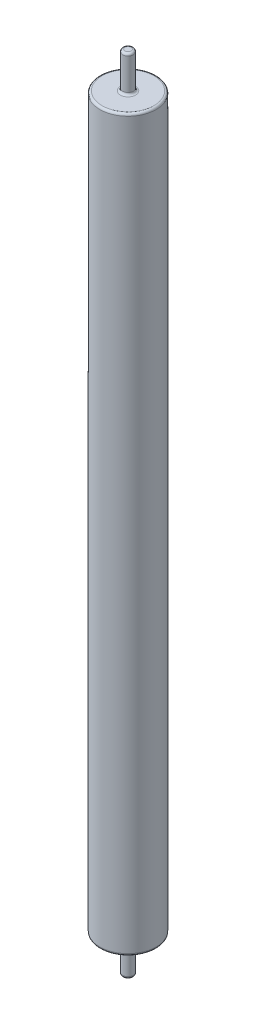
ISO-10303-21;
HEADER;
FILE_DESCRIPTION(('STEP AP214'),'2;1');
FILE_NAME('part.step','',(''),(''),'','','');
FILE_SCHEMA(('AUTOMOTIVE_DESIGN { 1 0 10303 214 1 1 1 1 }'));
ENDSEC;
DATA;
#1=APPLICATION_CONTEXT('core data for automotive mechanical design processes');
#2=APPLICATION_PROTOCOL_DEFINITION('international standard','automotive_design',2000,#1);
#3=PRODUCT_CONTEXT('',#1,'mechanical');
#4=PRODUCT('Part','Part','',(#3));
#5=PRODUCT_RELATED_PRODUCT_CATEGORY('part','',(#4));
#6=PRODUCT_DEFINITION_FORMATION('','',#4);
#7=PRODUCT_DEFINITION_CONTEXT('part definition',#1,'design');
#8=PRODUCT_DEFINITION('design','',#6,#7);
#9=PRODUCT_DEFINITION_SHAPE('','',#8);
#10=(LENGTH_UNIT() NAMED_UNIT(*) SI_UNIT(.MILLI.,.METRE.));
#11=(NAMED_UNIT(*) PLANE_ANGLE_UNIT() SI_UNIT($,.RADIAN.));
#12=(NAMED_UNIT(*) SI_UNIT($,.STERADIAN.) SOLID_ANGLE_UNIT());
#13=UNCERTAINTY_MEASURE_WITH_UNIT(LENGTH_MEASURE(1.E-05),#10,'distance_accuracy_value','');
#14=(GEOMETRIC_REPRESENTATION_CONTEXT(3) GLOBAL_UNCERTAINTY_ASSIGNED_CONTEXT((#13)) GLOBAL_UNIT_ASSIGNED_CONTEXT((#10,
#11,#12)) REPRESENTATION_CONTEXT('',''));
#15=CARTESIAN_POINT('',(0.,0.,0.));
#16=DIRECTION('',(0.,0.,1.));
#17=DIRECTION('',(1.,0.,0.));
#18=AXIS2_PLACEMENT_3D('',#15,#16,#17);
#19=CARTESIAN_POINT('',(0.,712.,0.));
#20=DIRECTION('',(0.,-1.,0.));
#21=DIRECTION('',(0.,0.,-1.));
#22=AXIS2_PLACEMENT_3D('',#19,#20,#21);
#23=CYLINDRICAL_SURFACE('',#22,25.);
#24=CARTESIAN_POINT('',(-24.4803692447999,337.95,-5.07065297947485));
#25=CARTESIAN_POINT('',(-24.4803704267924,338.033065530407,-5.07064911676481));
#26=CARTESIAN_POINT('',(-24.4818068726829,338.116190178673,-5.06372760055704));
#27=CARTESIAN_POINT('',(-24.4874759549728,338.280119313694,-5.03623969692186));
#28=CARTESIAN_POINT('',(-24.4917118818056,338.360920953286,-5.01565725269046));
#29=CARTESIAN_POINT('',(-24.5027368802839,338.517779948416,-4.96151622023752));
#30=CARTESIAN_POINT('',(-24.5095234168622,338.593841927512,-4.92797051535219));
#31=CARTESIAN_POINT('',(-24.5252820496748,338.739204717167,-4.84893353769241));
#32=CARTESIAN_POINT('',(-24.5342537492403,338.808506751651,-4.80344443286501));
#33=CARTESIAN_POINT('',(-24.5540326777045,338.939239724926,-4.70129837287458));
#34=CARTESIAN_POINT('',(-24.5648585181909,339.000578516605,-4.64452713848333));
#35=CARTESIAN_POINT('',(-24.5877554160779,339.11290568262,-4.52174491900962));
#36=CARTESIAN_POINT('',(-24.5998266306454,339.163892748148,-4.45573276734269));
#37=CARTESIAN_POINT('',(-24.6249023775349,339.255018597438,-4.31501722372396));
#38=CARTESIAN_POINT('',(-24.6379198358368,339.294944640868,-4.24017830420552));
#39=CARTESIAN_POINT('',(-24.6641433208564,339.361635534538,-4.08487836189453));
#40=CARTESIAN_POINT('',(-24.6773493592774,339.38839956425,-4.00441698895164));
#41=CARTESIAN_POINT('',(-24.7035764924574,339.428207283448,-3.83931697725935));
#42=CARTESIAN_POINT('',(-24.7165946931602,339.441120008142,-3.75464625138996));
#43=CARTESIAN_POINT('',(-24.7418818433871,339.452367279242,-3.58422959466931));
#44=CARTESIAN_POINT('',(-24.7541508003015,339.450701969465,-3.49848367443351));
#45=CARTESIAN_POINT('',(-24.7775641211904,339.432797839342,-3.32861065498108));
#46=CARTESIAN_POINT('',(-24.7887114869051,339.416599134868,-3.24447975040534));
#47=CARTESIAN_POINT('',(-24.8096794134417,339.370071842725,-3.08004553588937));
#48=CARTESIAN_POINT('',(-24.8195000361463,339.339743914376,-2.99974204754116));
#49=CARTESIAN_POINT('',(-24.8375915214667,339.266108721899,-2.84604775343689));
#50=CARTESIAN_POINT('',(-24.8458757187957,339.222922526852,-2.77260051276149));
#51=CARTESIAN_POINT('',(-24.8609550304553,339.124664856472,-2.63396742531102));
#52=CARTESIAN_POINT('',(-24.8677502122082,339.0695939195,-2.56878120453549));
#53=CARTESIAN_POINT('',(-24.8798208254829,338.949624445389,-2.44910440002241));
#54=CARTESIAN_POINT('',(-24.885108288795,338.884810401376,-2.39453031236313));
#55=CARTESIAN_POINT('',(-24.8942986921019,338.746863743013,-2.29701960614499));
#56=CARTESIAN_POINT('',(-24.8982016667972,338.673731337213,-2.25408269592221));
#57=CARTESIAN_POINT('',(-24.9046861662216,338.521576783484,-2.18127111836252));
#58=CARTESIAN_POINT('',(-24.9072734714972,338.442582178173,-2.15133939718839));
#59=CARTESIAN_POINT('',(-24.9112214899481,338.280665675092,-2.10513329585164));
#60=CARTESIAN_POINT('',(-24.9125822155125,338.197743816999,-2.0888587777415));
#61=CARTESIAN_POINT('',(-24.9141185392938,338.03046832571,-2.07045509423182));
#62=CARTESIAN_POINT('',(-24.9142960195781,337.946117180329,-2.06830346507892));
#63=CARTESIAN_POINT('',(-24.9134767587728,337.778250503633,-2.07814802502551));
#64=CARTESIAN_POINT('',(-24.9124800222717,337.694734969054,-2.09014415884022));
#65=CARTESIAN_POINT('',(-24.9092807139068,337.530934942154,-2.12793089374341));
#66=CARTESIAN_POINT('',(-24.9070784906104,337.450649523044,-2.15371750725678));
#67=CARTESIAN_POINT('',(-24.9014063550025,337.29556033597,-2.21833434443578));
#68=CARTESIAN_POINT('',(-24.8979364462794,337.220756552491,-2.25716453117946));
#69=CARTESIAN_POINT('',(-24.889650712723,337.078706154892,-2.34676475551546));
#70=CARTESIAN_POINT('',(-24.8848341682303,337.011463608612,-2.39754117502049));
#71=CARTESIAN_POINT('',(-24.8737881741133,336.886471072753,-2.50954580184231));
#72=CARTESIAN_POINT('',(-24.8675587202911,336.828721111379,-2.57077404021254));
#73=CARTESIAN_POINT('',(-24.8536372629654,336.724201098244,-2.70204967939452));
#74=CARTESIAN_POINT('',(-24.8459421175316,336.677455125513,-2.77211591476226));
#75=CARTESIAN_POINT('',(-24.829121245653,336.596375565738,-2.91893670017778));
#76=CARTESIAN_POINT('',(-24.8199954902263,336.5620422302,-2.99569138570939));
#77=CARTESIAN_POINT('',(-24.8003609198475,336.506536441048,-3.15412404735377));
#78=CARTESIAN_POINT('',(-24.7898449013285,336.485436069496,-3.23582637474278));
#79=CARTESIAN_POINT('',(-24.7676617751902,336.457206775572,-3.40145710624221));
#80=CARTESIAN_POINT('',(-24.7559946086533,336.450078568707,-3.48538562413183));
#81=CARTESIAN_POINT('',(-24.73169011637,336.449922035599,-3.65387631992));
#82=CARTESIAN_POINT('',(-24.7190450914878,336.457019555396,-3.73843750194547));
#83=CARTESIAN_POINT('',(-24.6932658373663,336.485317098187,-3.90509104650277));
#84=CARTESIAN_POINT('',(-24.680131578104,336.506517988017,-3.98718325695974));
#85=CARTESIAN_POINT('',(-24.6537322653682,336.562653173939,-4.14730374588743));
#86=CARTESIAN_POINT('',(-24.6404670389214,336.597701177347,-4.22529215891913));
#87=CARTESIAN_POINT('',(-24.6144582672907,336.680560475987,-4.37426207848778));
#88=CARTESIAN_POINT('',(-24.6017147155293,336.728371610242,-4.44524367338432));
#89=CARTESIAN_POINT('',(-24.5773234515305,336.835472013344,-4.57818167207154));
#90=CARTESIAN_POINT('',(-24.5656758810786,336.894762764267,-4.64013690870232));
#91=CARTESIAN_POINT('',(-24.54405238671,337.023217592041,-4.7531899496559));
#92=CARTESIAN_POINT('',(-24.5340767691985,337.092383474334,-4.80428576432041));
#93=CARTESIAN_POINT('',(-24.5164396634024,337.237754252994,-4.89348912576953));
#94=CARTESIAN_POINT('',(-24.5087521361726,337.313865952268,-4.931743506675));
#95=CARTESIAN_POINT('',(-24.4959709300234,337.471587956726,-4.9948428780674));
#96=CARTESIAN_POINT('',(-24.4908737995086,337.553190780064,-5.01970571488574));
#97=CARTESIAN_POINT('',(-24.4849498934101,337.6877964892,-5.04849934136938));
#98=CARTESIAN_POINT('',(-24.4832362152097,337.739867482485,-5.05679510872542));
#99=CARTESIAN_POINT('',(-24.4809455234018,337.844617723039,-5.06787311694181));
#100=CARTESIAN_POINT('',(-24.4803684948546,337.897296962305,-5.07065543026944));
#101=CARTESIAN_POINT('',(-24.4803692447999,337.95,-5.07065297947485));
#102=B_SPLINE_CURVE_WITH_KNOTS('',3,(#24,#25,#26,#27,#28,#29,#30,#31,#32,#33,#34,#35,#36,#37,
#38,#39,#40,#41,#42,#43,#44,#45,#46,#47,#48,#49,#50,#51,#52,#53,#54,#55,#56,#57,#58,#59,#60,#61,
#62,#63,#64,#65,#66,#67,#68,#69,#70,#71,#72,#73,#74,#75,#76,#77,#78,#79,#80,#81,#82,#83,#84,#85,
#86,#87,#88,#89,#90,#91,#92,#93,#94,#95,#96,#97,#98,#99,#100,#101),.UNSPECIFIED.,.T.,.F.,(4,2,2,
2,2,2,2,2,2,2,2,2,2,2,2,2,2,2,2,2,2,2,2,2,2,2,2,2,2,2,2,2,2,2,2,2,2,2,4),(0.,0.249001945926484,
0.498297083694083,0.747345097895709,0.996347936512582,1.24801489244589,1.49971364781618,
1.75596185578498,2.012226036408,2.27089241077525,2.5295562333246,2.7875082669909,
3.04544826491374,3.30103251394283,3.55660518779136,3.81007731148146,4.06354308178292,
4.31588538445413,4.56822513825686,4.82016342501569,5.07210072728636,5.32396522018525,
5.5758290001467,5.82782763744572,6.07982702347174,6.3323728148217,6.58492372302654,
6.83883863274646,7.09276654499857,7.34895071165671,7.60515062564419,7.86349960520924,
8.12184532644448,8.3802244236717,8.638650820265,8.89401271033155,9.14903344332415,
9.30702113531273,9.46500675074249),.UNSPECIFIED.);
#103=CARTESIAN_POINT('',(-24.4803692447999,337.95,-5.07065297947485));
#104=VERTEX_POINT('',#103);
#105=EDGE_CURVE('E41',#104,#104,#102,.T.);
#106=ORIENTED_EDGE('',*,*,#105,.T.);
#107=EDGE_LOOP('',(#106));
#108=FACE_BOUND('',#107,.T.);
#109=CARTESIAN_POINT('',(0.,34.,0.));
#110=DIRECTION('',(0.,-1.,0.));
#111=DIRECTION('',(0.,0.,-1.));
#112=AXIS2_PLACEMENT_3D('',#109,#110,#111);
#113=CIRCLE('',#112,25.);
#114=CARTESIAN_POINT('',(0.,34.,-25.));
#115=VERTEX_POINT('',#114);
#116=EDGE_CURVE('E68',#115,#115,#113,.F.);
#117=ORIENTED_EDGE('',*,*,#116,.T.);
#118=EDGE_LOOP('',(#117));
#119=FACE_BOUND('',#118,.T.);
#120=CARTESIAN_POINT('',(0.,678.,0.));
#121=DIRECTION('',(0.,1.,0.));
#122=DIRECTION('',(0.,0.,1.));
#123=AXIS2_PLACEMENT_3D('',#120,#121,#122);
#124=CIRCLE('',#123,25.);
#125=CARTESIAN_POINT('',(0.,678.,25.));
#126=VERTEX_POINT('',#125);
#127=EDGE_CURVE('E71',#126,#126,#124,.F.);
#128=ORIENTED_EDGE('',*,*,#127,.T.);
#129=EDGE_LOOP('',(#128));
#130=FACE_BOUND('',#129,.T.);
#131=ADVANCED_FACE('F37',(#108,#119,#130),#23,.T.);
#132=CARTESIAN_POINT('',(0.,680.,0.));
#133=DIRECTION('',(0.,1.,0.));
#134=DIRECTION('',(0.,0.,1.));
#135=AXIS2_PLACEMENT_3D('',#132,#133,#134);
#136=PLANE('',#135);
#137=CARTESIAN_POINT('',(0.,680.,0.));
#138=DIRECTION('',(0.,1.,0.));
#139=DIRECTION('',(0.,0.,1.));
#140=AXIS2_PLACEMENT_3D('',#137,#138,#139);
#141=CIRCLE('',#140,23.);
#142=CARTESIAN_POINT('',(0.,680.,23.));
#143=VERTEX_POINT('',#142);
#144=EDGE_CURVE('E50',#143,#143,#141,.T.);
#145=ORIENTED_EDGE('',*,*,#144,.T.);
#146=EDGE_LOOP('',(#145));
#147=FACE_BOUND('',#146,.T.);
#148=CARTESIAN_POINT('',(0.,680.,0.));
#149=DIRECTION('',(0.,1.,0.));
#150=DIRECTION('',(0.,0.,1.));
#151=AXIS2_PLACEMENT_3D('',#148,#149,#150);
#152=CIRCLE('',#151,6.7625);
#153=CARTESIAN_POINT('',(0.,680.,6.7625));
#154=VERTEX_POINT('',#153);
#155=EDGE_CURVE('E54',#154,#154,#152,.F.);
#156=ORIENTED_EDGE('',*,*,#155,.T.);
#157=EDGE_LOOP('',(#156));
#158=FACE_BOUND('',#157,.T.);
#159=ADVANCED_FACE('F109',(#147,#158),#136,.T.);
#160=CARTESIAN_POINT('',(0.,680.,0.));
#161=DIRECTION('',(0.,1.,0.));
#162=DIRECTION('',(0.,0.,1.));
#163=AXIS2_PLACEMENT_3D('',#160,#161,#162);
#164=CYLINDRICAL_SURFACE('',#163,4.7625);
#165=CARTESIAN_POINT('',(0.,710.,0.));
#166=DIRECTION('',(0.,1.,0.));
#167=DIRECTION('',(0.,0.,1.));
#168=AXIS2_PLACEMENT_3D('',#165,#166,#167);
#169=CIRCLE('',#168,4.7625);
#170=CARTESIAN_POINT('',(0.,710.,4.7625));
#171=VERTEX_POINT('',#170);
#172=EDGE_CURVE('E59',#171,#171,#169,.F.);
#173=ORIENTED_EDGE('',*,*,#172,.T.);
#174=EDGE_LOOP('',(#173));
#175=FACE_BOUND('',#174,.T.);
#176=CARTESIAN_POINT('',(0.,682.,0.));
#177=DIRECTION('',(0.,1.,0.));
#178=DIRECTION('',(0.,0.,1.));
#179=AXIS2_PLACEMENT_3D('',#176,#177,#178);
#180=CIRCLE('',#179,4.7625);
#181=CARTESIAN_POINT('',(0.,682.,4.7625));
#182=VERTEX_POINT('',#181);
#183=EDGE_CURVE('E62',#182,#182,#180,.T.);
#184=ORIENTED_EDGE('',*,*,#183,.T.);
#185=EDGE_LOOP('',(#184));
#186=FACE_BOUND('',#185,.T.);
#187=ADVANCED_FACE('F114',(#175,#186),#164,.T.);
#188=CARTESIAN_POINT('',(0.,712.,0.));
#189=DIRECTION('',(0.,1.,0.));
#190=DIRECTION('',(0.,0.,1.));
#191=AXIS2_PLACEMENT_3D('',#188,#189,#190);
#192=PLANE('',#191);
#193=CARTESIAN_POINT('',(0.,712.,0.));
#194=DIRECTION('',(0.,1.,0.));
#195=DIRECTION('',(0.,0.,1.));
#196=AXIS2_PLACEMENT_3D('',#193,#194,#195);
#197=CIRCLE('',#196,2.7625);
#198=CARTESIAN_POINT('',(0.,712.,2.7625));
#199=VERTEX_POINT('',#198);
#200=EDGE_CURVE('E65',#199,#199,#197,.T.);
#201=ORIENTED_EDGE('',*,*,#200,.T.);
#202=EDGE_LOOP('',(#201));
#203=FACE_BOUND('',#202,.T.);
#204=ADVANCED_FACE('F146',(#203),#192,.T.);
#205=CARTESIAN_POINT('',(0.,32.,0.));
#206=DIRECTION('',(0.,-1.,0.));
#207=DIRECTION('',(0.,0.,-1.));
#208=AXIS2_PLACEMENT_3D('',#205,#206,#207);
#209=PLANE('',#208);
#210=CARTESIAN_POINT('',(0.,32.,0.));
#211=DIRECTION('',(0.,-1.,0.));
#212=DIRECTION('',(0.,0.,-1.));
#213=AXIS2_PLACEMENT_3D('',#210,#211,#212);
#214=CIRCLE('',#213,6.7625);
#215=CARTESIAN_POINT('',(0.,32.,-6.7625));
#216=VERTEX_POINT('',#215);
#217=EDGE_CURVE('E74',#216,#216,#214,.F.);
#218=ORIENTED_EDGE('',*,*,#217,.T.);
#219=EDGE_LOOP('',(#218));
#220=FACE_BOUND('',#219,.T.);
#221=CARTESIAN_POINT('',(0.,32.,0.));
#222=DIRECTION('',(0.,-1.,0.));
#223=DIRECTION('',(0.,0.,-1.));
#224=AXIS2_PLACEMENT_3D('',#221,#222,#223);
#225=CIRCLE('',#224,23.);
#226=CARTESIAN_POINT('',(0.,32.,-23.));
#227=VERTEX_POINT('',#226);
#228=EDGE_CURVE('E77',#227,#227,#225,.T.);
#229=ORIENTED_EDGE('',*,*,#228,.T.);
#230=EDGE_LOOP('',(#229));
#231=FACE_BOUND('',#230,.T.);
#232=ADVANCED_FACE('F152',(#220,#231),#209,.T.);
#233=CARTESIAN_POINT('',(0.,32.,0.));
#234=DIRECTION('',(0.,-1.,0.));
#235=DIRECTION('',(0.,0.,-1.));
#236=AXIS2_PLACEMENT_3D('',#233,#234,#235);
#237=CYLINDRICAL_SURFACE('',#236,4.7625);
#238=CARTESIAN_POINT('',(0.,30.,0.));
#239=DIRECTION('',(0.,-1.,0.));
#240=DIRECTION('',(0.,0.,-1.));
#241=AXIS2_PLACEMENT_3D('',#238,#239,#240);
#242=CIRCLE('',#241,4.7625);
#243=CARTESIAN_POINT('',(0.,30.,-4.7625));
#244=VERTEX_POINT('',#243);
#245=EDGE_CURVE('E80',#244,#244,#242,.T.);
#246=ORIENTED_EDGE('',*,*,#245,.T.);
#247=EDGE_LOOP('',(#246));
#248=FACE_BOUND('',#247,.T.);
#249=CARTESIAN_POINT('',(0.,2.,0.));
#250=DIRECTION('',(0.,1.,0.));
#251=DIRECTION('',(0.,0.,1.));
#252=AXIS2_PLACEMENT_3D('',#249,#250,#251);
#253=CIRCLE('',#252,4.7625);
#254=CARTESIAN_POINT('',(0.,2.,4.7625));
#255=VERTEX_POINT('',#254);
#256=EDGE_CURVE('E83',#255,#255,#253,.T.);
#257=ORIENTED_EDGE('',*,*,#256,.T.);
#258=EDGE_LOOP('',(#257));
#259=FACE_BOUND('',#258,.T.);
#260=ADVANCED_FACE('F156',(#248,#259),#237,.T.);
#261=CARTESIAN_POINT('',(0.,0.,0.));
#262=DIRECTION('',(0.,1.,0.));
#263=DIRECTION('',(0.,0.,1.));
#264=AXIS2_PLACEMENT_3D('',#261,#262,#263);
#265=PLANE('',#264);
#266=CARTESIAN_POINT('',(0.,0.,0.));
#267=DIRECTION('',(0.,1.,0.));
#268=DIRECTION('',(0.,0.,1.));
#269=AXIS2_PLACEMENT_3D('',#266,#267,#268);
#270=CIRCLE('',#269,2.7625);
#271=CARTESIAN_POINT('',(0.,0.,2.7625));
#272=VERTEX_POINT('',#271);
#273=EDGE_CURVE('E10',#272,#272,#270,.F.);
#274=ORIENTED_EDGE('',*,*,#273,.T.);
#275=EDGE_LOOP('',(#274));
#276=FACE_BOUND('',#275,.T.);
#277=ADVANCED_FACE('F120',(#276),#265,.F.);
#278=CARTESIAN_POINT('',(0.,30.,0.));
#279=DIRECTION('',(0.,-1.,0.));
#280=DIRECTION('',(0.,0.,-1.));
#281=AXIS2_PLACEMENT_3D('',#278,#279,#280);
#282=TOROIDAL_SURFACE('',#281,6.7625,2.);
#283=ORIENTED_EDGE('',*,*,#217,.F.);
#284=EDGE_LOOP('',(#283));
#285=FACE_BOUND('',#284,.T.);
#286=ORIENTED_EDGE('',*,*,#245,.F.);
#287=EDGE_LOOP('',(#286));
#288=FACE_BOUND('',#287,.T.);
#289=ADVANCED_FACE('F122',(#285,#288),#282,.F.);
#290=CARTESIAN_POINT('',(0.,34.,0.));
#291=DIRECTION('',(0.,-1.,0.));
#292=DIRECTION('',(0.,0.,-1.));
#293=AXIS2_PLACEMENT_3D('',#290,#291,#292);
#294=TOROIDAL_SURFACE('',#293,23.,2.);
#295=ORIENTED_EDGE('',*,*,#116,.F.);
#296=EDGE_LOOP('',(#295));
#297=FACE_BOUND('',#296,.T.);
#298=ORIENTED_EDGE('',*,*,#228,.F.);
#299=EDGE_LOOP('',(#298));
#300=FACE_BOUND('',#299,.T.);
#301=ADVANCED_FACE('F125',(#297,#300),#294,.T.);
#302=CARTESIAN_POINT('',(0.,710.,0.));
#303=DIRECTION('',(0.,1.,0.));
#304=DIRECTION('',(0.,0.,1.));
#305=AXIS2_PLACEMENT_3D('',#302,#303,#304);
#306=TOROIDAL_SURFACE('',#305,2.7625,2.);
#307=ORIENTED_EDGE('',*,*,#172,.F.);
#308=EDGE_LOOP('',(#307));
#309=FACE_BOUND('',#308,.T.);
#310=ORIENTED_EDGE('',*,*,#200,.F.);
#311=EDGE_LOOP('',(#310));
#312=FACE_BOUND('',#311,.T.);
#313=ADVANCED_FACE('F129',(#309,#312),#306,.T.);
#314=CARTESIAN_POINT('',(0.,678.,0.));
#315=DIRECTION('',(0.,1.,0.));
#316=DIRECTION('',(0.,0.,1.));
#317=AXIS2_PLACEMENT_3D('',#314,#315,#316);
#318=TOROIDAL_SURFACE('',#317,23.,2.);
#319=ORIENTED_EDGE('',*,*,#127,.F.);
#320=EDGE_LOOP('',(#319));
#321=FACE_BOUND('',#320,.T.);
#322=ORIENTED_EDGE('',*,*,#144,.F.);
#323=EDGE_LOOP('',(#322));
#324=FACE_BOUND('',#323,.T.);
#325=ADVANCED_FACE('F133',(#321,#324),#318,.T.);
#326=CARTESIAN_POINT('',(0.,682.,0.));
#327=DIRECTION('',(0.,1.,0.));
#328=DIRECTION('',(0.,0.,1.));
#329=AXIS2_PLACEMENT_3D('',#326,#327,#328);
#330=TOROIDAL_SURFACE('',#329,6.7625,2.);
#331=ORIENTED_EDGE('',*,*,#155,.F.);
#332=EDGE_LOOP('',(#331));
#333=FACE_BOUND('',#332,.T.);
#334=ORIENTED_EDGE('',*,*,#183,.F.);
#335=EDGE_LOOP('',(#334));
#336=FACE_BOUND('',#335,.T.);
#337=ADVANCED_FACE('F104',(#333,#336),#330,.F.);
#338=CARTESIAN_POINT('',(0.,2.,0.));
#339=DIRECTION('',(0.,1.,0.));
#340=DIRECTION('',(0.,0.,1.));
#341=AXIS2_PLACEMENT_3D('',#338,#339,#340);
#342=TOROIDAL_SURFACE('',#341,2.7625,2.);
#343=ORIENTED_EDGE('',*,*,#256,.F.);
#344=EDGE_LOOP('',(#343));
#345=FACE_BOUND('',#344,.T.);
#346=ORIENTED_EDGE('',*,*,#273,.F.);
#347=EDGE_LOOP('',(#346));
#348=FACE_BOUND('',#347,.T.);
#349=ADVANCED_FACE('F39',(#345,#348),#342,.T.);
#350=CARTESIAN_POINT('',(-30.,337.95,-3.5706529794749));
#351=DIRECTION('',(1.,0.,0.));
#352=DIRECTION('',(0.,0.,-1.));
#353=AXIS2_PLACEMENT_3D('',#350,#351,#352);
#354=CYLINDRICAL_SURFACE('',#353,1.49999999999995);
#355=CARTESIAN_POINT('',(0.,337.95,-3.5706529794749));
#356=DIRECTION('',(1.,0.,0.));
#357=DIRECTION('',(0.,0.,-1.));
#358=AXIS2_PLACEMENT_3D('',#355,#356,#357);
#359=CIRCLE('',#358,1.49999999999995);
#360=CARTESIAN_POINT('',(0.,337.95,-5.07065297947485));
#361=VERTEX_POINT('',#360);
#362=EDGE_CURVE('E86',#361,#361,#359,.T.);
#363=ORIENTED_EDGE('',*,*,#362,.T.);
#364=EDGE_LOOP('',(#363));
#365=FACE_BOUND('',#364,.T.);
#366=ORIENTED_EDGE('',*,*,#105,.F.);
#367=EDGE_LOOP('',(#366));
#368=FACE_BOUND('',#367,.T.);
#369=ADVANCED_FACE('F95',(#365,#368),#354,.F.);
#370=CARTESIAN_POINT('',(0.,337.95,-3.5706529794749));
#371=DIRECTION('',(1.,0.,0.));
#372=DIRECTION('',(0.,0.,-1.));
#373=AXIS2_PLACEMENT_3D('',#370,#371,#372);
#374=PLANE('',#373);
#375=ORIENTED_EDGE('',*,*,#362,.F.);
#376=EDGE_LOOP('',(#375));
#377=FACE_BOUND('',#376,.T.);
#378=ADVANCED_FACE('F97',(#377),#374,.F.);
#379=CLOSED_SHELL('',(#131,#159,#187,#204,#232,#260,#277,#289,#301,#313,#325,#337,#349,#369,#378));
#380=MANIFOLD_SOLID_BREP('B2',#379);
#381=ADVANCED_BREP_SHAPE_REPRESENTATION('',(#18,#380),#14);
#382=SHAPE_DEFINITION_REPRESENTATION(#9,#381);
ENDSEC;
END-ISO-10303-21;
